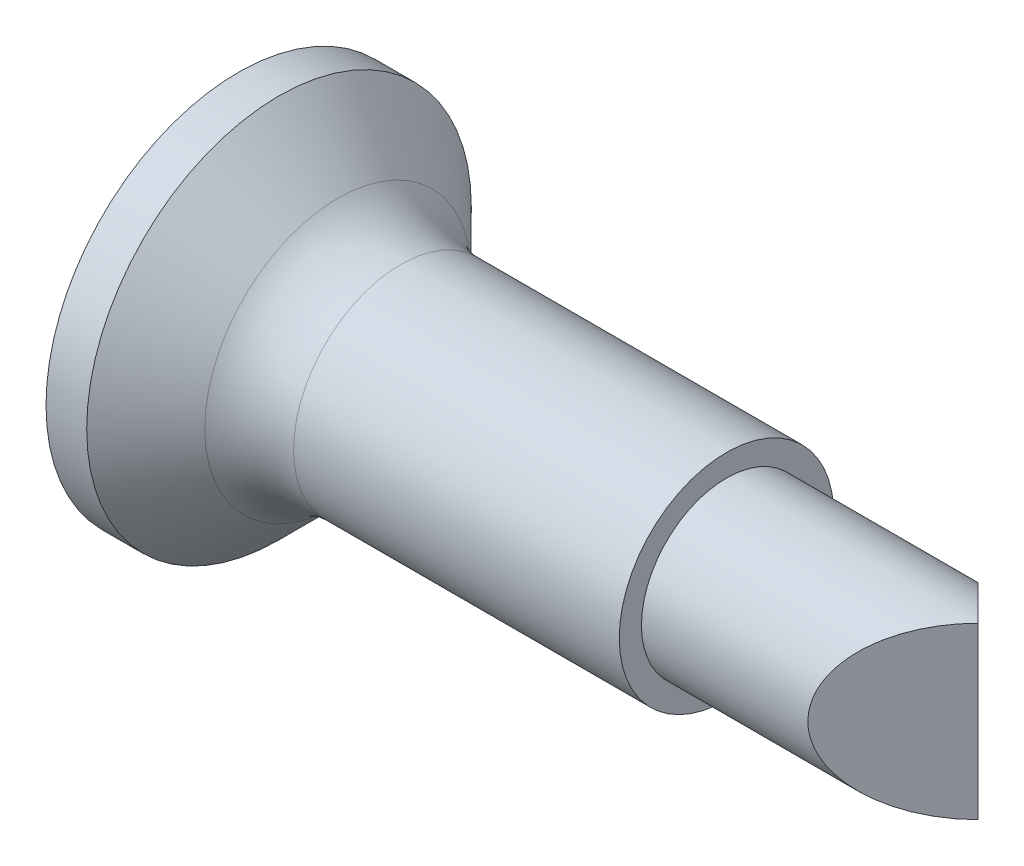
ISO-10303-21;
HEADER;
FILE_DESCRIPTION(('STEP AP214'),'2;1');
FILE_NAME('part.step','',(''),(''),'','','');
FILE_SCHEMA(('AUTOMOTIVE_DESIGN { 1 0 10303 214 1 1 1 1 }'));
ENDSEC;
DATA;
#1=APPLICATION_CONTEXT('core data for automotive mechanical design processes');
#2=APPLICATION_PROTOCOL_DEFINITION('international standard','automotive_design',2000,#1);
#3=PRODUCT_CONTEXT('',#1,'mechanical');
#4=PRODUCT('Part','Part','',(#3));
#5=PRODUCT_RELATED_PRODUCT_CATEGORY('part','',(#4));
#6=PRODUCT_DEFINITION_FORMATION('','',#4);
#7=PRODUCT_DEFINITION_CONTEXT('part definition',#1,'design');
#8=PRODUCT_DEFINITION('design','',#6,#7);
#9=PRODUCT_DEFINITION_SHAPE('','',#8);
#10=(LENGTH_UNIT() NAMED_UNIT(*) SI_UNIT(.MILLI.,.METRE.));
#11=(NAMED_UNIT(*) PLANE_ANGLE_UNIT() SI_UNIT($,.RADIAN.));
#12=(NAMED_UNIT(*) SI_UNIT($,.STERADIAN.) SOLID_ANGLE_UNIT());
#13=UNCERTAINTY_MEASURE_WITH_UNIT(LENGTH_MEASURE(1.E-05),#10,'distance_accuracy_value','');
#14=(GEOMETRIC_REPRESENTATION_CONTEXT(3) GLOBAL_UNCERTAINTY_ASSIGNED_CONTEXT((#13)) GLOBAL_UNIT_ASSIGNED_CONTEXT((#10,
#11,#12)) REPRESENTATION_CONTEXT('',''));
#15=CARTESIAN_POINT('',(0.,0.,0.));
#16=DIRECTION('',(0.,0.,1.));
#17=DIRECTION('',(1.,0.,0.));
#18=AXIS2_PLACEMENT_3D('',#15,#16,#17);
#19=CARTESIAN_POINT('',(5.17857142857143,0.,0.));
#20=DIRECTION('',(-1.,0.,0.));
#21=DIRECTION('',(0.,1.,0.));
#22=AXIS2_PLACEMENT_3D('',#19,#20,#21);
#23=SPHERICAL_SURFACE('',#22,5.17857142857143);
#24=CARTESIAN_POINT('',(0.700000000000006,0.,0.));
#25=DIRECTION('',(-1.,0.,0.));
#26=DIRECTION('',(0.,0.,1.));
#27=AXIS2_PLACEMENT_3D('',#24,#25,#26);
#28=CIRCLE('',#27,2.6);
#29=CARTESIAN_POINT('',(0.700000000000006,0.,2.6));
#30=VERTEX_POINT('',#29);
#31=EDGE_CURVE('E323',#30,#30,#28,.T.);
#32=ORIENTED_EDGE('',*,*,#31,.T.);
#33=EDGE_LOOP('',(#32));
#34=FACE_BOUND('',#33,.T.);
#35=CARTESIAN_POINT('',(5.17857142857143,0.,-0.34));
#36=DIRECTION('',(0.,0.,1.));
#37=DIRECTION('',(0.,-1.,0.));
#38=AXIS2_PLACEMENT_3D('',#35,#36,#37);
#39=CIRCLE('',#38,5.16739799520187);
#40=CARTESIAN_POINT('',(0.0561108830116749,-0.68,-0.34));
#41=VERTEX_POINT('',#40);
#42=CARTESIAN_POINT('',(0.258481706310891,-1.57946800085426,-0.339999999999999));
#43=VERTEX_POINT('',#42);
#44=EDGE_CURVE('E182',#41,#43,#39,.T.);
#45=ORIENTED_EDGE('',*,*,#44,.F.);
#46=CARTESIAN_POINT('',(0.0561108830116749,-0.68,-0.34));
#47=CARTESIAN_POINT('',(0.0536015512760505,-0.661113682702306,-0.339983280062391));
#48=CARTESIAN_POINT('',(0.0513035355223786,-0.642199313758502,-0.341572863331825));
#49=CARTESIAN_POINT('',(0.0471873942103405,-0.604850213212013,-0.347873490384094));
#50=CARTESIAN_POINT('',(0.0453691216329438,-0.586415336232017,-0.352583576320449));
#51=CARTESIAN_POINT('',(0.0422667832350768,-0.550533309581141,-0.36503951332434));
#52=CARTESIAN_POINT('',(0.0409831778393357,-0.533087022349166,-0.372787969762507));
#53=CARTESIAN_POINT('',(0.0389912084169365,-0.499715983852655,-0.391106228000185));
#54=CARTESIAN_POINT('',(0.0382826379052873,-0.483790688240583,-0.40167501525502));
#55=CARTESIAN_POINT('',(0.0374658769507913,-0.454064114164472,-0.425226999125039));
#56=CARTESIAN_POINT('',(0.0373521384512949,-0.440244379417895,-0.438186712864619));
#57=CARTESIAN_POINT('',(0.0377135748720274,-0.414947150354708,-0.46621652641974));
#58=CARTESIAN_POINT('',(0.038188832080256,-0.403469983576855,-0.48128692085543));
#59=CARTESIAN_POINT('',(0.0397105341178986,-0.383225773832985,-0.513032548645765));
#60=CARTESIAN_POINT('',(0.0407545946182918,-0.374447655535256,-0.529700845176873));
#61=CARTESIAN_POINT('',(0.0433814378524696,-0.359771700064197,-0.564219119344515));
#62=CARTESIAN_POINT('',(0.0449640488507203,-0.353872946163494,-0.582068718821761));
#63=CARTESIAN_POINT('',(0.0481065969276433,-0.346329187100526,-0.613328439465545));
#64=CARTESIAN_POINT('',(0.0495484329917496,-0.343955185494,-0.626579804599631));
#65=CARTESIAN_POINT('',(0.0526622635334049,-0.340790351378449,-0.653224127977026));
#66=CARTESIAN_POINT('',(0.0543339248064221,-0.339997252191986,-0.666616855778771));
#67=CARTESIAN_POINT('',(0.0561108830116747,-0.34,-0.679999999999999));
#68=B_SPLINE_CURVE_WITH_KNOTS('',3,(#46,#47,#48,#49,#50,#51,#52,#53,#54,#55,#56,#57,#58,#59,#60,
#61,#62,#63,#64,#65,#66,#67),.UNSPECIFIED.,.F.,.F.,(4,2,2,2,2,2,2,2,2,2,4),(0.,
0.0570896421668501,0.114161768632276,0.171282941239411,0.228383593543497,0.284950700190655,
0.341525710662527,0.397865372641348,0.454187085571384,0.494714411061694,0.535183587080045),.UNSPECIFIED.);
#69=CARTESIAN_POINT('',(0.0561108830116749,-0.34,-0.679999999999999));
#70=VERTEX_POINT('',#69);
#71=EDGE_CURVE('E217',#41,#70,#68,.T.);
#72=ORIENTED_EDGE('',*,*,#71,.T.);
#73=CARTESIAN_POINT('',(5.17857142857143,-0.34,0.));
#74=DIRECTION('',(0.,1.,0.));
#75=DIRECTION('',(0.,0.,1.));
#76=AXIS2_PLACEMENT_3D('',#73,#74,#75);
#77=CIRCLE('',#76,5.16739799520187);
#78=CARTESIAN_POINT('',(0.25848170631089,-0.339999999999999,-1.57946800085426));
#79=VERTEX_POINT('',#78);
#80=EDGE_CURVE('E165',#79,#70,#77,.T.);
#81=ORIENTED_EDGE('',*,*,#80,.F.);
#82=CARTESIAN_POINT('',(4.90478426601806,0.,0.587138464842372));
#83=DIRECTION('',(-0.4226182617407,0.,0.90630778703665));
#84=DIRECTION('',(0.90630778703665,0.,0.4226182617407));
#85=AXIS2_PLACEMENT_3D('',#82,#83,#84);
#86=CIRCLE('',#85,5.13788974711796);
#87=CARTESIAN_POINT('',(0.258481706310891,0.339999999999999,-1.57946800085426));
#88=VERTEX_POINT('',#87);
#89=EDGE_CURVE('E163',#88,#79,#86,.T.);
#90=ORIENTED_EDGE('',*,*,#89,.F.);
#91=CARTESIAN_POINT('',(5.17857142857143,0.339999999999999,0.));
#92=DIRECTION('',(0.,-1.,0.));
#93=DIRECTION('',(0.,0.,-1.));
#94=AXIS2_PLACEMENT_3D('',#91,#92,#93);
#95=CIRCLE('',#94,5.16739799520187);
#96=CARTESIAN_POINT('',(0.0561108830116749,0.339999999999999,-0.679999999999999));
#97=VERTEX_POINT('',#96);
#98=EDGE_CURVE('E166',#97,#88,#95,.T.);
#99=ORIENTED_EDGE('',*,*,#98,.F.);
#100=CARTESIAN_POINT('',(0.0561108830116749,0.339999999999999,-0.679999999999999));
#101=CARTESIAN_POINT('',(0.0536015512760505,0.339983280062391,-0.661113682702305));
#102=CARTESIAN_POINT('',(0.0513035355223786,0.341572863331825,-0.642199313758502));
#103=CARTESIAN_POINT('',(0.0471873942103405,0.347873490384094,-0.604850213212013));
#104=CARTESIAN_POINT('',(0.0453691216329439,0.352583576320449,-0.586415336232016));
#105=CARTESIAN_POINT('',(0.0422667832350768,0.36503951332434,-0.55053330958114));
#106=CARTESIAN_POINT('',(0.0409831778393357,0.372787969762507,-0.533087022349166));
#107=CARTESIAN_POINT('',(0.0389912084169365,0.391106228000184,-0.499715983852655));
#108=CARTESIAN_POINT('',(0.0382826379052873,0.40167501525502,-0.483790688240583));
#109=CARTESIAN_POINT('',(0.0374658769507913,0.425226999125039,-0.454064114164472));
#110=CARTESIAN_POINT('',(0.0373521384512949,0.438186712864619,-0.440244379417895));
#111=CARTESIAN_POINT('',(0.0377135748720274,0.46621652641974,-0.414947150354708));
#112=CARTESIAN_POINT('',(0.038188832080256,0.48128692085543,-0.403469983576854));
#113=CARTESIAN_POINT('',(0.0397105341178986,0.513032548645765,-0.383225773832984));
#114=CARTESIAN_POINT('',(0.0407545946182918,0.529700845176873,-0.374447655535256));
#115=CARTESIAN_POINT('',(0.0433814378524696,0.564219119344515,-0.359771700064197));
#116=CARTESIAN_POINT('',(0.0449640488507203,0.582068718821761,-0.353872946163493));
#117=CARTESIAN_POINT('',(0.0481065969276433,0.613328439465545,-0.346329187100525));
#118=CARTESIAN_POINT('',(0.0495484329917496,0.626579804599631,-0.343955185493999));
#119=CARTESIAN_POINT('',(0.0526622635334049,0.653224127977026,-0.340790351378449));
#120=CARTESIAN_POINT('',(0.0543339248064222,0.666616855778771,-0.339997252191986));
#121=CARTESIAN_POINT('',(0.0561108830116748,0.68,-0.339999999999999));
#122=B_SPLINE_CURVE_WITH_KNOTS('',3,(#100,#101,#102,#103,#104,#105,#106,#107,#108,#109,#110,
#111,#112,#113,#114,#115,#116,#117,#118,#119,#120,#121),.UNSPECIFIED.,.F.,.F.,(4,2,2,2,2,2,2,2,
2,2,4),(0.,0.0570896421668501,0.114161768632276,0.171282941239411,0.228383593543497,
0.284950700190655,0.341525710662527,0.397865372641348,0.454187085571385,0.494714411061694,
0.535183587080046),.UNSPECIFIED.);
#123=CARTESIAN_POINT('',(0.0561108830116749,0.68,-0.339999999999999));
#124=VERTEX_POINT('',#123);
#125=EDGE_CURVE('E244',#97,#124,#122,.T.);
#126=ORIENTED_EDGE('',*,*,#125,.T.);
#127=CARTESIAN_POINT('',(5.17857142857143,0.,-0.339999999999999));
#128=DIRECTION('',(0.,0.,1.));
#129=DIRECTION('',(0.,-1.,0.));
#130=AXIS2_PLACEMENT_3D('',#127,#128,#129);
#131=CIRCLE('',#130,5.16739799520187);
#132=CARTESIAN_POINT('',(0.258481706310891,1.57946800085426,-0.34));
#133=VERTEX_POINT('',#132);
#134=EDGE_CURVE('E138',#133,#124,#131,.T.);
#135=ORIENTED_EDGE('',*,*,#134,.F.);
#136=CARTESIAN_POINT('',(4.90478426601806,-0.587138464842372,0.));
#137=DIRECTION('',(-0.4226182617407,-0.90630778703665,0.));
#138=DIRECTION('',(0.90630778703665,-0.4226182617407,0.));
#139=AXIS2_PLACEMENT_3D('',#136,#137,#138);
#140=CIRCLE('',#139,5.13788974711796);
#141=CARTESIAN_POINT('',(0.258481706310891,1.57946800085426,0.34));
#142=VERTEX_POINT('',#141);
#143=EDGE_CURVE('E123',#142,#133,#140,.T.);
#144=ORIENTED_EDGE('',*,*,#143,.F.);
#145=CARTESIAN_POINT('',(5.17857142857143,0.,0.34));
#146=DIRECTION('',(0.,0.,-1.));
#147=DIRECTION('',(0.,1.,0.));
#148=AXIS2_PLACEMENT_3D('',#145,#146,#147);
#149=CIRCLE('',#148,5.16739799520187);
#150=CARTESIAN_POINT('',(0.0561108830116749,0.679999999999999,0.34));
#151=VERTEX_POINT('',#150);
#152=EDGE_CURVE('E139',#151,#142,#149,.T.);
#153=ORIENTED_EDGE('',*,*,#152,.F.);
#154=CARTESIAN_POINT('',(0.0561108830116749,0.679999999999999,0.34));
#155=CARTESIAN_POINT('',(0.0536015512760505,0.661113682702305,0.339983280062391));
#156=CARTESIAN_POINT('',(0.0513035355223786,0.642199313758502,0.341572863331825));
#157=CARTESIAN_POINT('',(0.0471873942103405,0.604850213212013,0.347873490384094));
#158=CARTESIAN_POINT('',(0.0453691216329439,0.586415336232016,0.352583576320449));
#159=CARTESIAN_POINT('',(0.0422667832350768,0.55053330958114,0.36503951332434));
#160=CARTESIAN_POINT('',(0.0409831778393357,0.533087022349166,0.372787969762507));
#161=CARTESIAN_POINT('',(0.0389912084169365,0.499715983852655,0.391106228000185));
#162=CARTESIAN_POINT('',(0.0382826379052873,0.483790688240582,0.401675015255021));
#163=CARTESIAN_POINT('',(0.0374658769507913,0.454064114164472,0.42522699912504));
#164=CARTESIAN_POINT('',(0.0373521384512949,0.440244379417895,0.43818671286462));
#165=CARTESIAN_POINT('',(0.0377135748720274,0.414947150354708,0.46621652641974));
#166=CARTESIAN_POINT('',(0.038188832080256,0.403469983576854,0.48128692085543));
#167=CARTESIAN_POINT('',(0.0397105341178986,0.383225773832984,0.513032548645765));
#168=CARTESIAN_POINT('',(0.0407545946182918,0.374447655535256,0.529700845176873));
#169=CARTESIAN_POINT('',(0.0433814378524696,0.359771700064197,0.564219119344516));
#170=CARTESIAN_POINT('',(0.0449640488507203,0.353872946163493,0.582068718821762));
#171=CARTESIAN_POINT('',(0.0481065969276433,0.346329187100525,0.613328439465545));
#172=CARTESIAN_POINT('',(0.0495484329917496,0.343955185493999,0.626579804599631));
#173=CARTESIAN_POINT('',(0.0526622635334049,0.340790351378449,0.653224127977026));
#174=CARTESIAN_POINT('',(0.0543339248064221,0.339997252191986,0.666616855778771));
#175=CARTESIAN_POINT('',(0.0561108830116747,0.339999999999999,0.68));
#176=B_SPLINE_CURVE_WITH_KNOTS('',3,(#154,#155,#156,#157,#158,#159,#160,#161,#162,#163,#164,
#165,#166,#167,#168,#169,#170,#171,#172,#173,#174,#175),.UNSPECIFIED.,.F.,.F.,(4,2,2,2,2,2,2,2,
2,2,4),(0.,0.0570896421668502,0.114161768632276,0.171282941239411,0.228383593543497,
0.284950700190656,0.341525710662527,0.397865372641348,0.454187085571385,0.494714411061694,
0.535183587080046),.UNSPECIFIED.);
#177=CARTESIAN_POINT('',(0.0561108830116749,0.339999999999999,0.68));
#178=VERTEX_POINT('',#177);
#179=EDGE_CURVE('E251',#151,#178,#176,.T.);
#180=ORIENTED_EDGE('',*,*,#179,.T.);
#181=CARTESIAN_POINT('',(5.17857142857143,0.339999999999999,0.));
#182=DIRECTION('',(0.,-1.,0.));
#183=DIRECTION('',(0.,0.,-1.));
#184=AXIS2_PLACEMENT_3D('',#181,#182,#183);
#185=CIRCLE('',#184,5.16739799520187);
#186=CARTESIAN_POINT('',(0.258481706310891,0.339999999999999,1.57946800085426));
#187=VERTEX_POINT('',#186);
#188=EDGE_CURVE('E176',#187,#178,#185,.T.);
#189=ORIENTED_EDGE('',*,*,#188,.F.);
#190=CARTESIAN_POINT('',(4.90478426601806,0.,-0.587138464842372));
#191=DIRECTION('',(-0.4226182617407,0.,-0.90630778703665));
#192=DIRECTION('',(-0.90630778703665,0.,0.4226182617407));
#193=AXIS2_PLACEMENT_3D('',#190,#191,#192);
#194=CIRCLE('',#193,5.13788974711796);
#195=CARTESIAN_POINT('',(0.258481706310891,-0.340000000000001,1.57946800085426));
#196=VERTEX_POINT('',#195);
#197=EDGE_CURVE('E174',#196,#187,#194,.T.);
#198=ORIENTED_EDGE('',*,*,#197,.F.);
#199=CARTESIAN_POINT('',(5.17857142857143,-0.34,0.));
#200=DIRECTION('',(0.,1.,0.));
#201=DIRECTION('',(0.,0.,1.));
#202=AXIS2_PLACEMENT_3D('',#199,#200,#201);
#203=CIRCLE('',#202,5.16739799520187);
#204=CARTESIAN_POINT('',(0.0561108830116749,-0.34,0.679999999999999));
#205=VERTEX_POINT('',#204);
#206=EDGE_CURVE('E177',#205,#196,#203,.T.);
#207=ORIENTED_EDGE('',*,*,#206,.F.);
#208=CARTESIAN_POINT('',(0.0561108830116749,-0.34,0.679999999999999));
#209=CARTESIAN_POINT('',(0.0536015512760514,-0.339983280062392,0.661113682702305));
#210=CARTESIAN_POINT('',(0.0513035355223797,-0.341572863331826,0.642199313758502));
#211=CARTESIAN_POINT('',(0.0471873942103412,-0.347873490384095,0.604850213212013));
#212=CARTESIAN_POINT('',(0.045369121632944,-0.35258357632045,0.586415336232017));
#213=CARTESIAN_POINT('',(0.0422667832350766,-0.365039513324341,0.55053330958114));
#214=CARTESIAN_POINT('',(0.0409831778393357,-0.372787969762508,0.533087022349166));
#215=CARTESIAN_POINT('',(0.0389912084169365,-0.391106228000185,0.499715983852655));
#216=CARTESIAN_POINT('',(0.0382826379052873,-0.401675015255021,0.483790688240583));
#217=CARTESIAN_POINT('',(0.0374658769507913,-0.42522699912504,0.454064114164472));
#218=CARTESIAN_POINT('',(0.0373521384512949,-0.43818671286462,0.440244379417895));
#219=CARTESIAN_POINT('',(0.0377135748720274,-0.46621652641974,0.414947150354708));
#220=CARTESIAN_POINT('',(0.038188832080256,-0.481286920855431,0.403469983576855));
#221=CARTESIAN_POINT('',(0.0397105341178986,-0.513032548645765,0.383225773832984));
#222=CARTESIAN_POINT('',(0.0407545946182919,-0.529700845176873,0.374447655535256));
#223=CARTESIAN_POINT('',(0.0433814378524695,-0.564219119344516,0.359771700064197));
#224=CARTESIAN_POINT('',(0.04496404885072,-0.582068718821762,0.353872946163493));
#225=CARTESIAN_POINT('',(0.0481065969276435,-0.613328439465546,0.346329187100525));
#226=CARTESIAN_POINT('',(0.0495484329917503,-0.626579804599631,0.343955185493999));
#227=CARTESIAN_POINT('',(0.052662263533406,-0.653224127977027,0.340790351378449));
#228=CARTESIAN_POINT('',(0.0543339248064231,-0.666616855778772,0.339997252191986));
#229=CARTESIAN_POINT('',(0.0561108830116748,-0.68,0.339999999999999));
#230=B_SPLINE_CURVE_WITH_KNOTS('',3,(#208,#209,#210,#211,#212,#213,#214,#215,#216,#217,#218,
#219,#220,#221,#222,#223,#224,#225,#226,#227,#228,#229),.UNSPECIFIED.,.F.,.F.,(4,2,2,2,2,2,2,2,
2,2,4),(0.,0.0570896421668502,0.114161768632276,0.171282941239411,0.228383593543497,
0.284950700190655,0.341525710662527,0.397865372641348,0.454187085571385,0.494714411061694,
0.535183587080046),.UNSPECIFIED.);
#231=CARTESIAN_POINT('',(0.0561108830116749,-0.68,0.339999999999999));
#232=VERTEX_POINT('',#231);
#233=EDGE_CURVE('E225',#205,#232,#230,.T.);
#234=ORIENTED_EDGE('',*,*,#233,.T.);
#235=CARTESIAN_POINT('',(5.17857142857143,0.,0.339999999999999));
#236=DIRECTION('',(0.,0.,-1.));
#237=DIRECTION('',(0.,1.,0.));
#238=AXIS2_PLACEMENT_3D('',#235,#236,#237);
#239=CIRCLE('',#238,5.16739799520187);
#240=CARTESIAN_POINT('',(0.258481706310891,-1.57946800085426,0.339999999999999));
#241=VERTEX_POINT('',#240);
#242=EDGE_CURVE('E152',#241,#232,#239,.T.);
#243=ORIENTED_EDGE('',*,*,#242,.F.);
#244=CARTESIAN_POINT('',(4.90478426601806,0.587138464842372,0.));
#245=DIRECTION('',(-0.4226182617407,0.90630778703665,0.));
#246=DIRECTION('',(-0.90630778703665,-0.4226182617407,0.));
#247=AXIS2_PLACEMENT_3D('',#244,#245,#246);
#248=CIRCLE('',#247,5.13788974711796);
#249=EDGE_CURVE('E150',#43,#241,#248,.T.);
#250=ORIENTED_EDGE('',*,*,#249,.F.);
#251=EDGE_LOOP('',(#45,#72,#81,#90,#99,#126,#135,#144,#153,#180,#189,#198,#207,#234,#243,#250));
#252=FACE_BOUND('',#251,.T.);
#253=ADVANCED_FACE('F36',(#34,#252),#23,.T.);
#254=CARTESIAN_POINT('',(-68.7142276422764,0.,0.));
#255=DIRECTION('',(-1.,0.,0.));
#256=DIRECTION('',(0.,0.,1.));
#257=AXIS2_PLACEMENT_3D('',#254,#255,#256);
#258=CYLINDRICAL_SURFACE('',#257,1.15);
#259=CARTESIAN_POINT('',(7.3,0.,0.));
#260=DIRECTION('',(-1.,0.,0.));
#261=DIRECTION('',(0.,0.,1.));
#262=AXIS2_PLACEMENT_3D('',#259,#260,#261);
#263=CIRCLE('',#262,1.15);
#264=CARTESIAN_POINT('',(7.3,0.,1.15));
#265=VERTEX_POINT('',#264);
#266=EDGE_CURVE('E333',#265,#265,#263,.T.);
#267=ORIENTED_EDGE('',*,*,#266,.F.);
#268=EDGE_LOOP('',(#267));
#269=FACE_BOUND('',#268,.T.);
#270=CARTESIAN_POINT('',(10.7,0.,0.));
#271=DIRECTION('',(-0.707106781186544,0.,0.707106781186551));
#272=DIRECTION('',(-0.707106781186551,0.,-0.707106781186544));
#273=AXIS2_PLACEMENT_3D('',#270,#271,#272);
#274=ELLIPSE('',#273,1.62634559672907,1.15);
#275=CARTESIAN_POINT('',(10.7,1.15,0.));
#276=VERTEX_POINT('',#275);
#277=CARTESIAN_POINT('',(10.7,-1.15,0.));
#278=VERTEX_POINT('',#277);
#279=EDGE_CURVE('E336',#276,#278,#274,.T.);
#280=ORIENTED_EDGE('',*,*,#279,.T.);
#281=CARTESIAN_POINT('',(10.7,0.,0.));
#282=DIRECTION('',(-0.707106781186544,0.,-0.707106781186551));
#283=DIRECTION('',(-0.707106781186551,0.,0.707106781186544));
#284=AXIS2_PLACEMENT_3D('',#281,#282,#283);
#285=ELLIPSE('',#284,1.62634559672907,1.15);
#286=EDGE_CURVE('E153',#278,#276,#285,.T.);
#287=ORIENTED_EDGE('',*,*,#286,.T.);
#288=EDGE_LOOP('',(#280,#287));
#289=FACE_BOUND('',#288,.T.);
#290=ADVANCED_FACE('F237',(#269,#289),#258,.T.);
#291=CARTESIAN_POINT('',(7.3,1.45,0.));
#292=DIRECTION('',(-1.,0.,0.));
#293=DIRECTION('',(0.,0.,1.));
#294=AXIS2_PLACEMENT_3D('',#291,#292,#293);
#295=PLANE('',#294);
#296=CARTESIAN_POINT('',(7.3,0.,0.));
#297=DIRECTION('',(-1.,0.,0.));
#298=DIRECTION('',(0.,0.,1.));
#299=AXIS2_PLACEMENT_3D('',#296,#297,#298);
#300=CIRCLE('',#299,1.45);
#301=CARTESIAN_POINT('',(7.3,0.,1.45));
#302=VERTEX_POINT('',#301);
#303=EDGE_CURVE('E330',#302,#302,#300,.T.);
#304=ORIENTED_EDGE('',*,*,#303,.F.);
#305=EDGE_LOOP('',(#304));
#306=FACE_BOUND('',#305,.T.);
#307=ORIENTED_EDGE('',*,*,#266,.T.);
#308=EDGE_LOOP('',(#307));
#309=FACE_BOUND('',#308,.T.);
#310=ADVANCED_FACE('F413',(#306,#309),#295,.F.);
#311=CARTESIAN_POINT('',(-68.7142276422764,0.,0.));
#312=DIRECTION('',(-1.,0.,0.));
#313=DIRECTION('',(0.,0.,1.));
#314=AXIS2_PLACEMENT_3D('',#311,#312,#313);
#315=CYLINDRICAL_SURFACE('',#314,1.45);
#316=CARTESIAN_POINT('',(2.89705627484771,0.,0.));
#317=DIRECTION('',(-1.,0.,0.));
#318=DIRECTION('',(0.,0.,1.));
#319=AXIS2_PLACEMENT_3D('',#316,#317,#318);
#320=CIRCLE('',#319,1.45);
#321=CARTESIAN_POINT('',(2.89705627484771,0.,1.45));
#322=VERTEX_POINT('',#321);
#323=EDGE_CURVE('E343',#322,#322,#320,.F.);
#324=ORIENTED_EDGE('',*,*,#323,.T.);
#325=EDGE_LOOP('',(#324));
#326=FACE_BOUND('',#325,.T.);
#327=ORIENTED_EDGE('',*,*,#303,.T.);
#328=EDGE_LOOP('',(#327));
#329=FACE_BOUND('',#328,.T.);
#330=ADVANCED_FACE('F418',(#326,#329),#315,.T.);
#331=CARTESIAN_POINT('',(2.4,0.,0.));
#332=DIRECTION('',(-1.,0.,0.));
#333=DIRECTION('',(0.,0.,1.));
#334=AXIS2_PLACEMENT_3D('',#331,#332,#333);
#335=CONICAL_SURFACE('',#334,1.45,0.785398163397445);
#336=CARTESIAN_POINT('',(2.04852813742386,0.,0.));
#337=DIRECTION('',(-1.,0.,0.));
#338=DIRECTION('',(0.,0.,1.));
#339=AXIS2_PLACEMENT_3D('',#336,#337,#338);
#340=CIRCLE('',#339,1.80147186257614);
#341=CARTESIAN_POINT('',(2.04852813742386,0.,1.80147186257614));
#342=VERTEX_POINT('',#341);
#343=EDGE_CURVE('E184',#342,#342,#340,.T.);
#344=ORIENTED_EDGE('',*,*,#343,.T.);
#345=EDGE_LOOP('',(#344));
#346=FACE_BOUND('',#345,.T.);
#347=CARTESIAN_POINT('',(1.25,0.,0.));
#348=DIRECTION('',(-1.,0.,0.));
#349=DIRECTION('',(0.,0.,1.));
#350=AXIS2_PLACEMENT_3D('',#347,#348,#349);
#351=CIRCLE('',#350,2.59999999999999);
#352=CARTESIAN_POINT('',(1.25,0.,2.59999999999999));
#353=VERTEX_POINT('',#352);
#354=EDGE_CURVE('E326',#353,#353,#351,.T.);
#355=ORIENTED_EDGE('',*,*,#354,.F.);
#356=EDGE_LOOP('',(#355));
#357=FACE_BOUND('',#356,.T.);
#358=ADVANCED_FACE('F425',(#346,#357),#335,.T.);
#359=CARTESIAN_POINT('',(-68.7142276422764,0.,0.));
#360=DIRECTION('',(-1.,0.,0.));
#361=DIRECTION('',(0.,0.,1.));
#362=AXIS2_PLACEMENT_3D('',#359,#360,#361);
#363=CYLINDRICAL_SURFACE('',#362,2.6);
#364=ORIENTED_EDGE('',*,*,#31,.F.);
#365=EDGE_LOOP('',(#364));
#366=FACE_BOUND('',#365,.T.);
#367=ORIENTED_EDGE('',*,*,#354,.T.);
#368=EDGE_LOOP('',(#367));
#369=FACE_BOUND('',#368,.T.);
#370=ADVANCED_FACE('F432',(#366,#369),#363,.T.);
#371=CARTESIAN_POINT('',(10.7,-2.6,0.));
#372=DIRECTION('',(-0.707106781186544,0.,-0.707106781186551));
#373=DIRECTION('',(-0.707106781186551,0.,0.707106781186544));
#374=AXIS2_PLACEMENT_3D('',#371,#372,#373);
#375=PLANE('',#374);
#376=DIRECTION('',(0.,1.,0.));
#377=VECTOR('',#376,1.);
#378=CARTESIAN_POINT('',(10.7,-2.6,0.));
#379=LINE('',#378,#377);
#380=EDGE_CURVE('E157',#278,#276,#379,.T.);
#381=ORIENTED_EDGE('',*,*,#380,.T.);
#382=ORIENTED_EDGE('',*,*,#286,.F.);
#383=EDGE_LOOP('',(#381,#382));
#384=FACE_BOUND('',#383,.T.);
#385=ADVANCED_FACE('F411',(#384),#375,.F.);
#386=CARTESIAN_POINT('',(10.7,-2.6,0.));
#387=DIRECTION('',(-0.707106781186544,0.,0.707106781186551));
#388=DIRECTION('',(0.707106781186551,0.,0.707106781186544));
#389=AXIS2_PLACEMENT_3D('',#386,#387,#388);
#390=PLANE('',#389);
#391=ORIENTED_EDGE('',*,*,#380,.F.);
#392=ORIENTED_EDGE('',*,*,#279,.F.);
#393=EDGE_LOOP('',(#391,#392));
#394=FACE_BOUND('',#393,.T.);
#395=ADVANCED_FACE('F407',(#394),#390,.F.);
#396=CARTESIAN_POINT('',(0.85,-1.7,-0.339999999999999));
#397=DIRECTION('',(0.,0.,1.));
#398=DIRECTION('',(0.,-1.,0.));
#399=AXIS2_PLACEMENT_3D('',#396,#397,#398);
#400=PLANE('',#399);
#401=DIRECTION('',(0.,1.,0.));
#402=VECTOR('',#401,1.);
#403=CARTESIAN_POINT('',(0.85,-1.7,-0.339999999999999));
#404=LINE('',#403,#402);
#405=CARTESIAN_POINT('',(0.85,-1.30363849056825,-0.34));
#406=VERTEX_POINT('',#405);
#407=CARTESIAN_POINT('',(0.85,-0.68,-0.34));
#408=VERTEX_POINT('',#407);
#409=EDGE_CURVE('E368',#406,#408,#404,.T.);
#410=ORIENTED_EDGE('',*,*,#409,.T.);
#411=DIRECTION('',(-1.,0.,0.));
#412=VECTOR('',#411,1.);
#413=CARTESIAN_POINT('',(0.85,-0.68,-0.34));
#414=LINE('',#413,#412);
#415=EDGE_CURVE('E345',#408,#41,#414,.T.);
#416=ORIENTED_EDGE('',*,*,#415,.T.);
#417=ORIENTED_EDGE('',*,*,#44,.T.);
#418=DIRECTION('',(-0.90630778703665,-0.4226182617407,0.));
#419=VECTOR('',#418,1.);
#420=CARTESIAN_POINT('',(0.698184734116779,-1.37443111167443,-0.339999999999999));
#421=LINE('',#420,#419);
#422=EDGE_CURVE('E144',#406,#43,#421,.T.);
#423=ORIENTED_EDGE('',*,*,#422,.F.);
#424=EDGE_LOOP('',(#410,#416,#417,#423));
#425=FACE_BOUND('',#424,.T.);
#426=ADVANCED_FACE('F370',(#425),#400,.T.);
#427=CARTESIAN_POINT('',(0.85,-0.339999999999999,-1.7));
#428=DIRECTION('',(0.,1.,0.));
#429=DIRECTION('',(0.,0.,1.));
#430=AXIS2_PLACEMENT_3D('',#427,#428,#429);
#431=PLANE('',#430);
#432=ORIENTED_EDGE('',*,*,#80,.T.);
#433=DIRECTION('',(-1.,0.,0.));
#434=VECTOR('',#433,1.);
#435=CARTESIAN_POINT('',(0.85,-0.34,-0.679999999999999));
#436=LINE('',#435,#434);
#437=CARTESIAN_POINT('',(0.85,-0.34,-0.679999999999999));
#438=VERTEX_POINT('',#437);
#439=EDGE_CURVE('E214',#70,#438,#436,.F.);
#440=ORIENTED_EDGE('',*,*,#439,.T.);
#441=DIRECTION('',(0.,0.,-1.));
#442=VECTOR('',#441,1.);
#443=CARTESIAN_POINT('',(0.85,-0.339999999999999,-1.7));
#444=LINE('',#443,#442);
#445=CARTESIAN_POINT('',(0.85,-0.34,-1.30363849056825));
#446=VERTEX_POINT('',#445);
#447=EDGE_CURVE('E160',#438,#446,#444,.T.);
#448=ORIENTED_EDGE('',*,*,#447,.T.);
#449=DIRECTION('',(-0.90630778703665,0.,-0.4226182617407));
#450=VECTOR('',#449,1.);
#451=CARTESIAN_POINT('',(0.,-0.339999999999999,-1.7));
#452=LINE('',#451,#450);
#453=EDGE_CURVE('E154',#446,#79,#452,.T.);
#454=ORIENTED_EDGE('',*,*,#453,.T.);
#455=EDGE_LOOP('',(#432,#440,#448,#454));
#456=FACE_BOUND('',#455,.T.);
#457=ADVANCED_FACE('F381',(#456),#431,.T.);
#458=CARTESIAN_POINT('',(0.,0.,-1.7));
#459=DIRECTION('',(-0.4226182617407,0.,0.90630778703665));
#460=DIRECTION('',(0.90630778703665,0.,0.4226182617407));
#461=AXIS2_PLACEMENT_3D('',#458,#459,#460);
#462=PLANE('',#461);
#463=ORIENTED_EDGE('',*,*,#89,.T.);
#464=ORIENTED_EDGE('',*,*,#453,.F.);
#465=DIRECTION('',(0.,1.,0.));
#466=VECTOR('',#465,1.);
#467=CARTESIAN_POINT('',(0.85,0.,-1.30363849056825));
#468=LINE('',#467,#466);
#469=CARTESIAN_POINT('',(0.85,0.339999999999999,-1.30363849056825));
#470=VERTEX_POINT('',#469);
#471=EDGE_CURVE('E158',#446,#470,#468,.T.);
#472=ORIENTED_EDGE('',*,*,#471,.T.);
#473=DIRECTION('',(-0.90630778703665,0.,-0.4226182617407));
#474=VECTOR('',#473,1.);
#475=CARTESIAN_POINT('',(0.698184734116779,0.339999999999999,-1.37443111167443));
#476=LINE('',#475,#474);
#477=EDGE_CURVE('E124',#470,#88,#476,.T.);
#478=ORIENTED_EDGE('',*,*,#477,.T.);
#479=EDGE_LOOP('',(#463,#464,#472,#478));
#480=FACE_BOUND('',#479,.T.);
#481=ADVANCED_FACE('F38',(#480),#462,.T.);
#482=CARTESIAN_POINT('',(0.85,0.339999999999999,-1.7));
#483=DIRECTION('',(0.,-1.,0.));
#484=DIRECTION('',(0.,0.,-1.));
#485=AXIS2_PLACEMENT_3D('',#482,#483,#484);
#486=PLANE('',#485);
#487=DIRECTION('',(0.,0.,1.));
#488=VECTOR('',#487,1.);
#489=CARTESIAN_POINT('',(0.85,0.339999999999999,-1.7));
#490=LINE('',#489,#488);
#491=CARTESIAN_POINT('',(0.85,0.339999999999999,-0.679999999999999));
#492=VERTEX_POINT('',#491);
#493=EDGE_CURVE('E115',#470,#492,#490,.T.);
#494=ORIENTED_EDGE('',*,*,#493,.T.);
#495=DIRECTION('',(-1.,0.,0.));
#496=VECTOR('',#495,1.);
#497=CARTESIAN_POINT('',(0.85,0.339999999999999,-0.679999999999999));
#498=LINE('',#497,#496);
#499=EDGE_CURVE('E199',#492,#97,#498,.T.);
#500=ORIENTED_EDGE('',*,*,#499,.T.);
#501=ORIENTED_EDGE('',*,*,#98,.T.);
#502=ORIENTED_EDGE('',*,*,#477,.F.);
#503=EDGE_LOOP('',(#494,#500,#501,#502));
#504=FACE_BOUND('',#503,.T.);
#505=ADVANCED_FACE('F364',(#504),#486,.T.);
#506=CARTESIAN_POINT('',(0.85,0.339999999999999,-0.339999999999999));
#507=DIRECTION('',(0.,0.,1.));
#508=DIRECTION('',(0.,-1.,0.));
#509=AXIS2_PLACEMENT_3D('',#506,#507,#508);
#510=PLANE('',#509);
#511=ORIENTED_EDGE('',*,*,#134,.T.);
#512=DIRECTION('',(-1.,0.,0.));
#513=VECTOR('',#512,1.);
#514=CARTESIAN_POINT('',(0.85,0.68,-0.339999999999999));
#515=LINE('',#514,#513);
#516=CARTESIAN_POINT('',(0.85,0.68,-0.339999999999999));
#517=VERTEX_POINT('',#516);
#518=EDGE_CURVE('E55',#124,#517,#515,.F.);
#519=ORIENTED_EDGE('',*,*,#518,.T.);
#520=DIRECTION('',(0.,1.,0.));
#521=VECTOR('',#520,1.);
#522=CARTESIAN_POINT('',(0.85,0.339999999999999,-0.339999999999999));
#523=LINE('',#522,#521);
#524=CARTESIAN_POINT('',(0.85,1.30363849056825,-0.34));
#525=VERTEX_POINT('',#524);
#526=EDGE_CURVE('E107',#517,#525,#523,.T.);
#527=ORIENTED_EDGE('',*,*,#526,.T.);
#528=DIRECTION('',(-0.90630778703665,0.4226182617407,0.));
#529=VECTOR('',#528,1.);
#530=CARTESIAN_POINT('',(0.,1.7,-0.34));
#531=LINE('',#530,#529);
#532=EDGE_CURVE('E40',#525,#133,#531,.T.);
#533=ORIENTED_EDGE('',*,*,#532,.T.);
#534=EDGE_LOOP('',(#511,#519,#527,#533));
#535=FACE_BOUND('',#534,.T.);
#536=ADVANCED_FACE('F109',(#535),#510,.T.);
#537=CARTESIAN_POINT('',(0.,1.7,0.));
#538=DIRECTION('',(-0.4226182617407,-0.90630778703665,0.));
#539=DIRECTION('',(0.90630778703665,-0.4226182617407,0.));
#540=AXIS2_PLACEMENT_3D('',#537,#538,#539);
#541=PLANE('',#540);
#542=ORIENTED_EDGE('',*,*,#143,.T.);
#543=ORIENTED_EDGE('',*,*,#532,.F.);
#544=DIRECTION('',(0.,0.,1.));
#545=VECTOR('',#544,1.);
#546=CARTESIAN_POINT('',(0.85,1.30363849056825,0.));
#547=LINE('',#546,#545);
#548=CARTESIAN_POINT('',(0.85,1.30363849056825,0.34));
#549=VERTEX_POINT('',#548);
#550=EDGE_CURVE('E114',#525,#549,#547,.T.);
#551=ORIENTED_EDGE('',*,*,#550,.T.);
#552=DIRECTION('',(-0.90630778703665,0.4226182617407,0.));
#553=VECTOR('',#552,1.);
#554=CARTESIAN_POINT('',(1.21909495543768,1.13152668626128,0.34));
#555=LINE('',#554,#553);
#556=EDGE_CURVE('E125',#549,#142,#555,.T.);
#557=ORIENTED_EDGE('',*,*,#556,.T.);
#558=EDGE_LOOP('',(#542,#543,#551,#557));
#559=FACE_BOUND('',#558,.T.);
#560=ADVANCED_FACE('F119',(#559),#541,.T.);
#561=CARTESIAN_POINT('',(0.85,0.339999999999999,0.34));
#562=DIRECTION('',(0.,0.,-1.));
#563=DIRECTION('',(0.,1.,0.));
#564=AXIS2_PLACEMENT_3D('',#561,#562,#563);
#565=PLANE('',#564);
#566=DIRECTION('',(0.,-1.,0.));
#567=VECTOR('',#566,1.);
#568=CARTESIAN_POINT('',(0.85,0.339999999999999,0.34));
#569=LINE('',#568,#567);
#570=CARTESIAN_POINT('',(0.85,0.679999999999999,0.34));
#571=VERTEX_POINT('',#570);
#572=EDGE_CURVE('E131',#549,#571,#569,.T.);
#573=ORIENTED_EDGE('',*,*,#572,.T.);
#574=DIRECTION('',(-1.,0.,0.));
#575=VECTOR('',#574,1.);
#576=CARTESIAN_POINT('',(0.85,0.679999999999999,0.34));
#577=LINE('',#576,#575);
#578=EDGE_CURVE('E205',#571,#151,#577,.T.);
#579=ORIENTED_EDGE('',*,*,#578,.T.);
#580=ORIENTED_EDGE('',*,*,#152,.T.);
#581=ORIENTED_EDGE('',*,*,#556,.F.);
#582=EDGE_LOOP('',(#573,#579,#580,#581));
#583=FACE_BOUND('',#582,.T.);
#584=ADVANCED_FACE('F275',(#583),#565,.T.);
#585=CARTESIAN_POINT('',(0.85,0.339999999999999,0.34));
#586=DIRECTION('',(0.,-1.,0.));
#587=DIRECTION('',(0.,0.,-1.));
#588=AXIS2_PLACEMENT_3D('',#585,#586,#587);
#589=PLANE('',#588);
#590=ORIENTED_EDGE('',*,*,#188,.T.);
#591=DIRECTION('',(-1.,0.,0.));
#592=VECTOR('',#591,1.);
#593=CARTESIAN_POINT('',(0.85,0.339999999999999,0.68));
#594=LINE('',#593,#592);
#595=CARTESIAN_POINT('',(0.85,0.339999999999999,0.68));
#596=VERTEX_POINT('',#595);
#597=EDGE_CURVE('E202',#178,#596,#594,.F.);
#598=ORIENTED_EDGE('',*,*,#597,.T.);
#599=DIRECTION('',(0.,0.,1.));
#600=VECTOR('',#599,1.);
#601=CARTESIAN_POINT('',(0.85,0.339999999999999,0.34));
#602=LINE('',#601,#600);
#603=CARTESIAN_POINT('',(0.85,0.339999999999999,1.30363849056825));
#604=VERTEX_POINT('',#603);
#605=EDGE_CURVE('E132',#596,#604,#602,.T.);
#606=ORIENTED_EDGE('',*,*,#605,.T.);
#607=DIRECTION('',(-0.90630778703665,0.,0.4226182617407));
#608=VECTOR('',#607,1.);
#609=CARTESIAN_POINT('',(0.,0.339999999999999,1.7));
#610=LINE('',#609,#608);
#611=EDGE_CURVE('E136',#604,#187,#610,.T.);
#612=ORIENTED_EDGE('',*,*,#611,.T.);
#613=EDGE_LOOP('',(#590,#598,#606,#612));
#614=FACE_BOUND('',#613,.T.);
#615=ADVANCED_FACE('F272',(#614),#589,.T.);
#616=CARTESIAN_POINT('',(0.,0.,1.7));
#617=DIRECTION('',(-0.4226182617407,0.,-0.90630778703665));
#618=DIRECTION('',(-0.90630778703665,0.,0.4226182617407));
#619=AXIS2_PLACEMENT_3D('',#616,#617,#618);
#620=PLANE('',#619);
#621=ORIENTED_EDGE('',*,*,#197,.T.);
#622=ORIENTED_EDGE('',*,*,#611,.F.);
#623=DIRECTION('',(0.,-1.,0.));
#624=VECTOR('',#623,1.);
#625=CARTESIAN_POINT('',(0.85,0.,1.30363849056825));
#626=LINE('',#625,#624);
#627=CARTESIAN_POINT('',(0.85,-0.340000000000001,1.30363849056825));
#628=VERTEX_POINT('',#627);
#629=EDGE_CURVE('E169',#604,#628,#626,.T.);
#630=ORIENTED_EDGE('',*,*,#629,.T.);
#631=DIRECTION('',(-0.90630778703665,0.,0.4226182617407));
#632=VECTOR('',#631,1.);
#633=CARTESIAN_POINT('',(1.21909495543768,-0.340000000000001,1.13152668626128));
#634=LINE('',#633,#632);
#635=EDGE_CURVE('E143',#628,#196,#634,.T.);
#636=ORIENTED_EDGE('',*,*,#635,.T.);
#637=EDGE_LOOP('',(#621,#622,#630,#636));
#638=FACE_BOUND('',#637,.T.);
#639=ADVANCED_FACE('F268',(#638),#620,.T.);
#640=CARTESIAN_POINT('',(0.85,-0.34,0.339999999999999));
#641=DIRECTION('',(0.,1.,0.));
#642=DIRECTION('',(0.,0.,1.));
#643=AXIS2_PLACEMENT_3D('',#640,#641,#642);
#644=PLANE('',#643);
#645=DIRECTION('',(0.,0.,-1.));
#646=VECTOR('',#645,1.);
#647=CARTESIAN_POINT('',(0.85,-0.34,0.339999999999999));
#648=LINE('',#647,#646);
#649=CARTESIAN_POINT('',(0.85,-0.34,0.679999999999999));
#650=VERTEX_POINT('',#649);
#651=EDGE_CURVE('E171',#628,#650,#648,.T.);
#652=ORIENTED_EDGE('',*,*,#651,.T.);
#653=DIRECTION('',(-1.,0.,0.));
#654=VECTOR('',#653,1.);
#655=CARTESIAN_POINT('',(0.85,-0.34,0.679999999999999));
#656=LINE('',#655,#654);
#657=EDGE_CURVE('E211',#650,#205,#656,.T.);
#658=ORIENTED_EDGE('',*,*,#657,.T.);
#659=ORIENTED_EDGE('',*,*,#206,.T.);
#660=ORIENTED_EDGE('',*,*,#635,.F.);
#661=EDGE_LOOP('',(#652,#658,#659,#660));
#662=FACE_BOUND('',#661,.T.);
#663=ADVANCED_FACE('F271',(#662),#644,.T.);
#664=CARTESIAN_POINT('',(0.85,-1.7,0.339999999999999));
#665=DIRECTION('',(0.,0.,-1.));
#666=DIRECTION('',(0.,1.,0.));
#667=AXIS2_PLACEMENT_3D('',#664,#665,#666);
#668=PLANE('',#667);
#669=ORIENTED_EDGE('',*,*,#242,.T.);
#670=DIRECTION('',(-1.,0.,0.));
#671=VECTOR('',#670,1.);
#672=CARTESIAN_POINT('',(0.85,-0.68,0.339999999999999));
#673=LINE('',#672,#671);
#674=CARTESIAN_POINT('',(0.85,-0.68,0.339999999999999));
#675=VERTEX_POINT('',#674);
#676=EDGE_CURVE('E208',#232,#675,#673,.F.);
#677=ORIENTED_EDGE('',*,*,#676,.T.);
#678=DIRECTION('',(0.,-1.,0.));
#679=VECTOR('',#678,1.);
#680=CARTESIAN_POINT('',(0.85,-1.7,0.339999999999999));
#681=LINE('',#680,#679);
#682=CARTESIAN_POINT('',(0.85,-1.30363849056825,0.339999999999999));
#683=VERTEX_POINT('',#682);
#684=EDGE_CURVE('E147',#675,#683,#681,.T.);
#685=ORIENTED_EDGE('',*,*,#684,.T.);
#686=DIRECTION('',(-0.90630778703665,-0.4226182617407,0.));
#687=VECTOR('',#686,1.);
#688=CARTESIAN_POINT('',(0.,-1.7,0.339999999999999));
#689=LINE('',#688,#687);
#690=EDGE_CURVE('E140',#683,#241,#689,.T.);
#691=ORIENTED_EDGE('',*,*,#690,.T.);
#692=EDGE_LOOP('',(#669,#677,#685,#691));
#693=FACE_BOUND('',#692,.T.);
#694=ADVANCED_FACE('F278',(#693),#668,.T.);
#695=CARTESIAN_POINT('',(0.,-1.7,0.));
#696=DIRECTION('',(-0.4226182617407,0.90630778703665,0.));
#697=DIRECTION('',(-0.90630778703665,-0.4226182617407,0.));
#698=AXIS2_PLACEMENT_3D('',#695,#696,#697);
#699=PLANE('',#698);
#700=ORIENTED_EDGE('',*,*,#249,.T.);
#701=ORIENTED_EDGE('',*,*,#690,.F.);
#702=DIRECTION('',(0.,0.,-1.));
#703=VECTOR('',#702,1.);
#704=CARTESIAN_POINT('',(0.85,-1.30363849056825,0.));
#705=LINE('',#704,#703);
#706=EDGE_CURVE('E145',#683,#406,#705,.T.);
#707=ORIENTED_EDGE('',*,*,#706,.T.);
#708=ORIENTED_EDGE('',*,*,#422,.T.);
#709=EDGE_LOOP('',(#700,#701,#707,#708));
#710=FACE_BOUND('',#709,.T.);
#711=ADVANCED_FACE('F276',(#710),#699,.T.);
#712=CARTESIAN_POINT('',(0.85,0.339999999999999,-0.34));
#713=DIRECTION('',(1.,0.,0.));
#714=DIRECTION('',(0.,0.,-1.));
#715=AXIS2_PLACEMENT_3D('',#712,#713,#714);
#716=PLANE('',#715);
#717=ORIENTED_EDGE('',*,*,#409,.F.);
#718=ORIENTED_EDGE('',*,*,#706,.F.);
#719=ORIENTED_EDGE('',*,*,#684,.F.);
#720=CARTESIAN_POINT('',(0.85,-0.68,0.679999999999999));
#721=DIRECTION('',(1.,0.,0.));
#722=DIRECTION('',(0.,0.,-1.));
#723=AXIS2_PLACEMENT_3D('',#720,#721,#722);
#724=CIRCLE('',#723,0.34);
#725=EDGE_CURVE('E192',#675,#650,#724,.T.);
#726=ORIENTED_EDGE('',*,*,#725,.T.);
#727=ORIENTED_EDGE('',*,*,#651,.F.);
#728=ORIENTED_EDGE('',*,*,#629,.F.);
#729=ORIENTED_EDGE('',*,*,#605,.F.);
#730=CARTESIAN_POINT('',(0.85,0.679999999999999,0.68));
#731=DIRECTION('',(1.,0.,0.));
#732=DIRECTION('',(0.,0.,-1.));
#733=AXIS2_PLACEMENT_3D('',#730,#731,#732);
#734=CIRCLE('',#733,0.34);
#735=EDGE_CURVE('E46',#596,#571,#734,.T.);
#736=ORIENTED_EDGE('',*,*,#735,.T.);
#737=ORIENTED_EDGE('',*,*,#572,.F.);
#738=ORIENTED_EDGE('',*,*,#550,.F.);
#739=ORIENTED_EDGE('',*,*,#526,.F.);
#740=CARTESIAN_POINT('',(0.85,0.679999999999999,-0.679999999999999));
#741=DIRECTION('',(1.,0.,0.));
#742=DIRECTION('',(0.,0.,-1.));
#743=AXIS2_PLACEMENT_3D('',#740,#741,#742);
#744=CIRCLE('',#743,0.34);
#745=EDGE_CURVE('E11',#517,#492,#744,.T.);
#746=ORIENTED_EDGE('',*,*,#745,.T.);
#747=ORIENTED_EDGE('',*,*,#493,.F.);
#748=ORIENTED_EDGE('',*,*,#471,.F.);
#749=ORIENTED_EDGE('',*,*,#447,.F.);
#750=CARTESIAN_POINT('',(0.85,-0.68,-0.68));
#751=DIRECTION('',(1.,0.,0.));
#752=DIRECTION('',(0.,0.,-1.));
#753=AXIS2_PLACEMENT_3D('',#750,#751,#752);
#754=CIRCLE('',#753,0.34);
#755=EDGE_CURVE('E195',#438,#408,#754,.T.);
#756=ORIENTED_EDGE('',*,*,#755,.T.);
#757=EDGE_LOOP('',(#717,#718,#719,#726,#727,#728,#729,#736,#737,#738,#739,#746,#747,#748,#749,#756));
#758=FACE_BOUND('',#757,.T.);
#759=ADVANCED_FACE('F128',(#758),#716,.F.);
#760=CARTESIAN_POINT('',(2.89705627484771,0.,0.));
#761=DIRECTION('',(-1.,0.,0.));
#762=DIRECTION('',(0.,0.,1.));
#763=AXIS2_PLACEMENT_3D('',#760,#761,#762);
#764=TOROIDAL_SURFACE('',#763,2.65,1.2);
#765=ORIENTED_EDGE('',*,*,#323,.F.);
#766=EDGE_LOOP('',(#765));
#767=FACE_BOUND('',#766,.T.);
#768=ORIENTED_EDGE('',*,*,#343,.F.);
#769=EDGE_LOOP('',(#768));
#770=FACE_BOUND('',#769,.T.);
#771=ADVANCED_FACE('F240',(#767,#770),#764,.F.);
#772=CARTESIAN_POINT('',(0.85,-0.68,-0.68));
#773=DIRECTION('',(-1.,0.,0.));
#774=DIRECTION('',(0.,0.,1.));
#775=AXIS2_PLACEMENT_3D('',#772,#773,#774);
#776=CYLINDRICAL_SURFACE('',#775,0.34);
#777=ORIENTED_EDGE('',*,*,#755,.F.);
#778=ORIENTED_EDGE('',*,*,#439,.F.);
#779=ORIENTED_EDGE('',*,*,#71,.F.);
#780=ORIENTED_EDGE('',*,*,#415,.F.);
#781=EDGE_LOOP('',(#777,#778,#779,#780));
#782=FACE_BOUND('',#781,.T.);
#783=ADVANCED_FACE('F231',(#782),#776,.T.);
#784=CARTESIAN_POINT('',(0.85,-0.68,0.679999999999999));
#785=DIRECTION('',(-1.,0.,0.));
#786=DIRECTION('',(0.,0.,1.));
#787=AXIS2_PLACEMENT_3D('',#784,#785,#786);
#788=CYLINDRICAL_SURFACE('',#787,0.34);
#789=ORIENTED_EDGE('',*,*,#725,.F.);
#790=ORIENTED_EDGE('',*,*,#676,.F.);
#791=ORIENTED_EDGE('',*,*,#233,.F.);
#792=ORIENTED_EDGE('',*,*,#657,.F.);
#793=EDGE_LOOP('',(#789,#790,#791,#792));
#794=FACE_BOUND('',#793,.T.);
#795=ADVANCED_FACE('F261',(#794),#788,.T.);
#796=CARTESIAN_POINT('',(0.85,0.679999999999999,0.68));
#797=DIRECTION('',(-1.,0.,0.));
#798=DIRECTION('',(0.,0.,1.));
#799=AXIS2_PLACEMENT_3D('',#796,#797,#798);
#800=CYLINDRICAL_SURFACE('',#799,0.34);
#801=ORIENTED_EDGE('',*,*,#735,.F.);
#802=ORIENTED_EDGE('',*,*,#597,.F.);
#803=ORIENTED_EDGE('',*,*,#179,.F.);
#804=ORIENTED_EDGE('',*,*,#578,.F.);
#805=EDGE_LOOP('',(#801,#802,#803,#804));
#806=FACE_BOUND('',#805,.T.);
#807=ADVANCED_FACE('F257',(#806),#800,.T.);
#808=CARTESIAN_POINT('',(0.85,0.679999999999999,-0.679999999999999));
#809=DIRECTION('',(-1.,0.,0.));
#810=DIRECTION('',(0.,0.,1.));
#811=AXIS2_PLACEMENT_3D('',#808,#809,#810);
#812=CYLINDRICAL_SURFACE('',#811,0.34);
#813=ORIENTED_EDGE('',*,*,#745,.F.);
#814=ORIENTED_EDGE('',*,*,#518,.F.);
#815=ORIENTED_EDGE('',*,*,#125,.F.);
#816=ORIENTED_EDGE('',*,*,#499,.F.);
#817=EDGE_LOOP('',(#813,#814,#815,#816));
#818=FACE_BOUND('',#817,.T.);
#819=ADVANCED_FACE('F260',(#818),#812,.T.);
#820=CLOSED_SHELL('',(#253,#290,#310,#330,#358,#370,#385,#395,#426,#457,#481,#505,#536,#560,
#584,#615,#639,#663,#694,#711,#759,#771,#783,#795,#807,#819));
#821=MANIFOLD_SOLID_BREP('B2',#820);
#822=ADVANCED_BREP_SHAPE_REPRESENTATION('',(#18,#821),#14);
#823=SHAPE_DEFINITION_REPRESENTATION(#9,#822);
ENDSEC;
END-ISO-10303-21;
